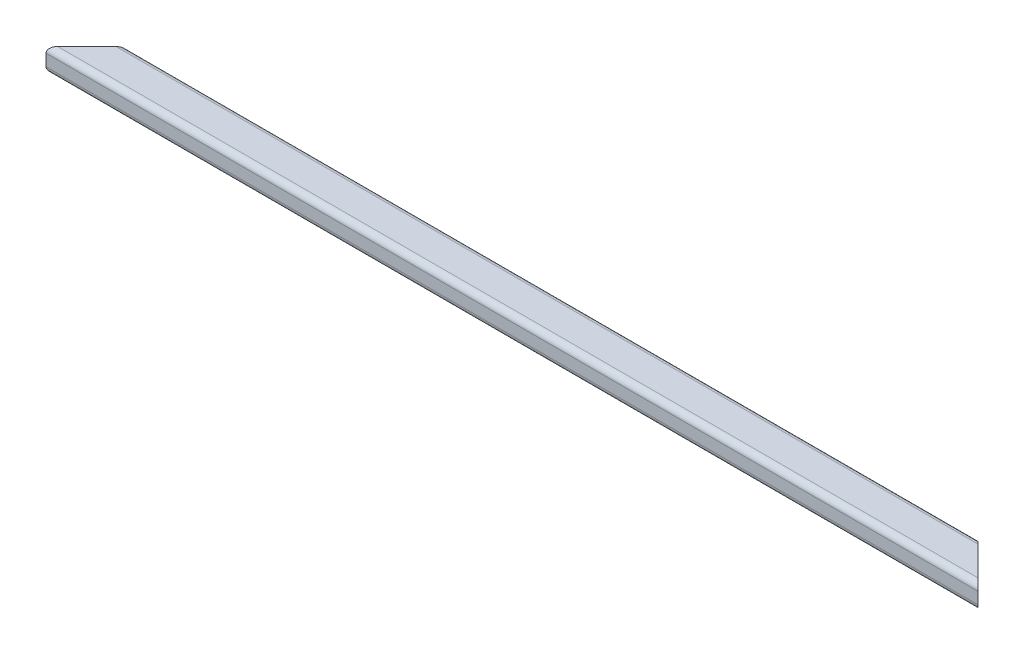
from build123d import *

# Parameters (mm, degrees)
BASE_EXTRUSION_DEPTH    = 800
ENL_V_MAT_EXTRU_1_DEPTH = 801.441284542


with BuildPart() as part:
    # Esquisse1 → Base-Extrusion (new body)
    with BuildSketch(Plane(origin=(0, 0, 0), x_dir=(0, 0, -1), z_dir=(1, 0, 0))):
        with BuildLine():
            Line((-12.5, 10), (12.5, 10))
            ThreePointArc((12.5, 10), (16.035533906, 8.535533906), (17.5, 5))
            Line((17.5, 5), (17.5, -5))
            ThreePointArc((17.5, -5), (16.035533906, -8.535533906), (12.5, -10))
            Line((12.5, -10), (-12.5, -10))
            ThreePointArc((-12.5, -10), (-16.035533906, -8.535533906), (-17.5, -5))
            Line((-17.5, -5), (-17.5, 5))
            ThreePointArc((-17.5, 5), (-16.035533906, 8.535533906), (-12.5, 10))
        make_face()
        with BuildLine():
            Line((-12.5, 7.5), (12.5, 7.5))
            ThreePointArc((12.5, 7.5), (14.267766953, 6.767766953), (15, 5))
            Line((15, 5), (15, -5))
            ThreePointArc((15, -5), (14.267766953, -6.767766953), (12.5, -7.5))
            Line((12.5, -7.5), (-12.5, -7.5))
            ThreePointArc((-12.5, -7.5), (-14.267766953, -6.767766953), (-15, -5))
            Line((-15, -5), (-15, 5))
            ThreePointArc((-15, 5), (-14.267766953, 6.767766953), (-12.5, 7.5))
        make_face(mode=Mode.SUBTRACT)
    extrude(amount=BASE_EXTRUSION_DEPTH)

    # Esquisse2 → Enl_v. mat.-Extru.1 (cut, through all)
    with BuildSketch(Plane(origin=(0, 10, 0), x_dir=(-1, 0, 0), z_dir=(0, 1, 0))):
        Polygon((-800, 17.5), (-765, -17.5), (-800, -17.5), align=None)
        Polygon((0, 17.5), (-35, -17.5), (0, -17.5), align=None)
    extrude(amount=-ENL_V_MAT_EXTRU_1_DEPTH, mode=Mode.SUBTRACT)


solid = part.part
